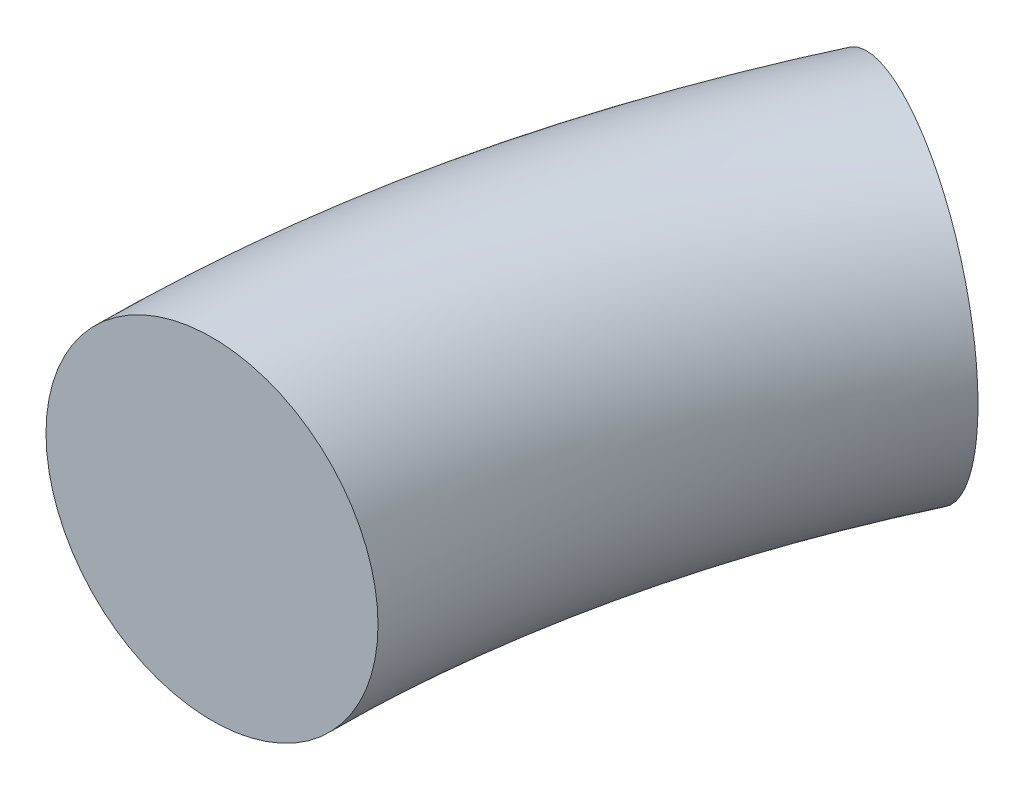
from build123d import *

# Parameters (mm, degrees)
SKETCH1_R      = 0.5953125
REVOLVE1_ANGLE = 25


with BuildPart() as part:
    # Sketch1 → Revolve1 (revolve)
    with BuildSketch(Plane.XY):
        with Locations((-34.863612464, 9.382164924)):
            Circle(SKETCH1_R)
    revolve(axis=Axis((-30.101112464, 41.568202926, 0), (0, -1, 0)), revolution_arc=REVOLVE1_ANGLE)


solid = part.part
